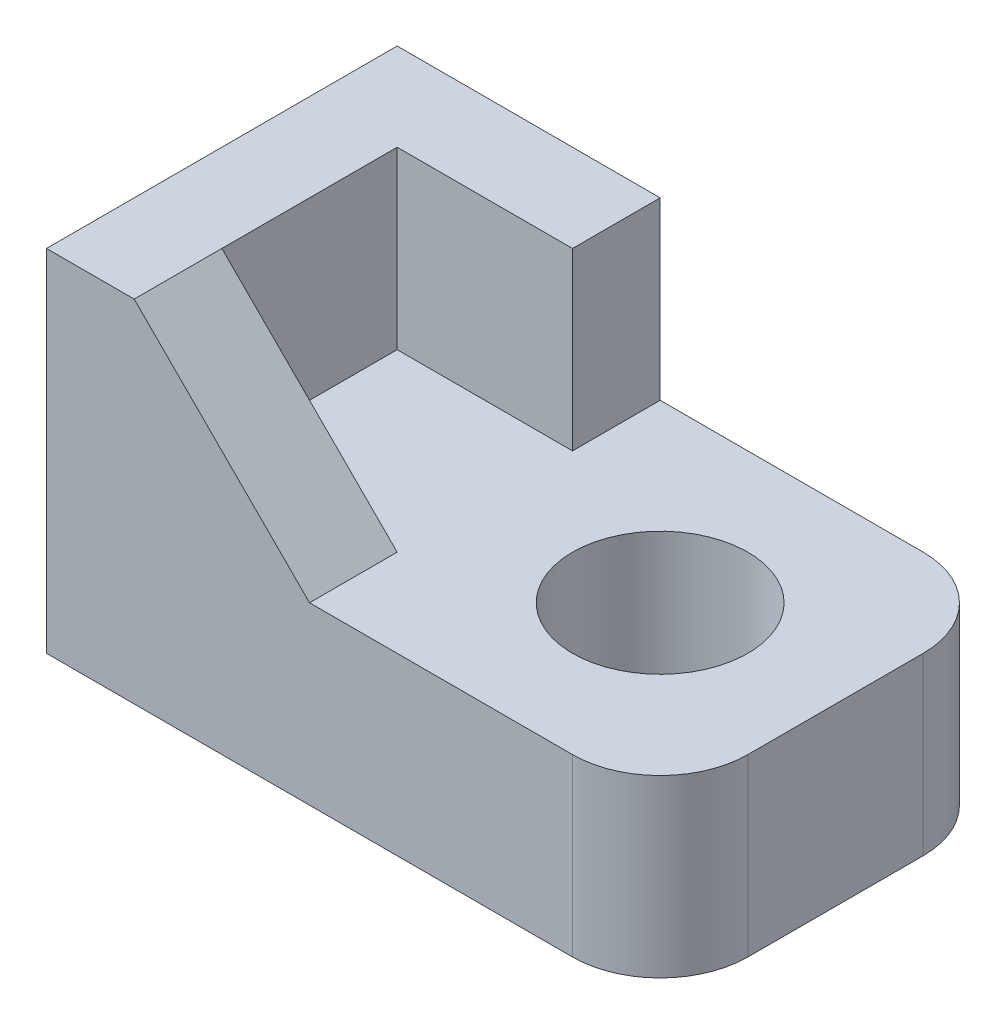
ISO-10303-21;
HEADER;
FILE_DESCRIPTION(('STEP AP214'),'2;1');
FILE_NAME('part.step','',(''),(''),'','','');
FILE_SCHEMA(('AUTOMOTIVE_DESIGN { 1 0 10303 214 1 1 1 1 }'));
ENDSEC;
DATA;
#1=APPLICATION_CONTEXT('core data for automotive mechanical design processes');
#2=APPLICATION_PROTOCOL_DEFINITION('international standard','automotive_design',2000,#1);
#3=PRODUCT_CONTEXT('',#1,'mechanical');
#4=PRODUCT('Part','Part','',(#3));
#5=PRODUCT_RELATED_PRODUCT_CATEGORY('part','',(#4));
#6=PRODUCT_DEFINITION_FORMATION('','',#4);
#7=PRODUCT_DEFINITION_CONTEXT('part definition',#1,'design');
#8=PRODUCT_DEFINITION('design','',#6,#7);
#9=PRODUCT_DEFINITION_SHAPE('','',#8);
#10=(LENGTH_UNIT() NAMED_UNIT(*) SI_UNIT(.MILLI.,.METRE.));
#11=(NAMED_UNIT(*) PLANE_ANGLE_UNIT() SI_UNIT($,.RADIAN.));
#12=(NAMED_UNIT(*) SI_UNIT($,.STERADIAN.) SOLID_ANGLE_UNIT());
#13=UNCERTAINTY_MEASURE_WITH_UNIT(LENGTH_MEASURE(1.E-05),#10,'distance_accuracy_value','');
#14=(GEOMETRIC_REPRESENTATION_CONTEXT(3) GLOBAL_UNCERTAINTY_ASSIGNED_CONTEXT((#13)) GLOBAL_UNIT_ASSIGNED_CONTEXT((#10,
#11,#12)) REPRESENTATION_CONTEXT('',''));
#15=CARTESIAN_POINT('',(0.,0.,0.));
#16=DIRECTION('',(0.,0.,1.));
#17=DIRECTION('',(1.,0.,0.));
#18=AXIS2_PLACEMENT_3D('',#15,#16,#17);
#19=CARTESIAN_POINT('',(30.,40.,20.));
#20=DIRECTION('',(0.,-1.,0.));
#21=DIRECTION('',(1.,0.,0.));
#22=AXIS2_PLACEMENT_3D('',#19,#20,#21);
#23=PLANE('',#22);
#24=DIRECTION('',(0.,0.,-1.));
#25=VECTOR('',#24,1.);
#26=CARTESIAN_POINT('',(10.,40.,20.));
#27=LINE('',#26,#25);
#28=CARTESIAN_POINT('',(10.,40.,20.));
#29=VERTEX_POINT('',#28);
#30=CARTESIAN_POINT('',(10.,40.,10.));
#31=VERTEX_POINT('',#30);
#32=EDGE_CURVE('E119',#29,#31,#27,.T.);
#33=ORIENTED_EDGE('',*,*,#32,.T.);
#34=DIRECTION('',(0.,0.,1.));
#35=VECTOR('',#34,1.);
#36=CARTESIAN_POINT('',(10.,40.,-10.));
#37=LINE('',#36,#35);
#38=CARTESIAN_POINT('',(10.,40.,-10.));
#39=VERTEX_POINT('',#38);
#40=EDGE_CURVE('E223',#39,#31,#37,.T.);
#41=ORIENTED_EDGE('',*,*,#40,.F.);
#42=DIRECTION('',(-1.,0.,0.));
#43=VECTOR('',#42,1.);
#44=CARTESIAN_POINT('',(20.,40.,-10.));
#45=LINE('',#44,#43);
#46=CARTESIAN_POINT('',(30.,40.,-10.));
#47=VERTEX_POINT('',#46);
#48=EDGE_CURVE('E227',#47,#39,#45,.T.);
#49=ORIENTED_EDGE('',*,*,#48,.F.);
#50=DIRECTION('',(0.,0.,-1.));
#51=VECTOR('',#50,1.);
#52=CARTESIAN_POINT('',(30.,40.,20.));
#53=LINE('',#52,#51);
#54=CARTESIAN_POINT('',(30.,40.,-20.));
#55=VERTEX_POINT('',#54);
#56=EDGE_CURVE('E145',#47,#55,#53,.T.);
#57=ORIENTED_EDGE('',*,*,#56,.T.);
#58=DIRECTION('',(-1.,0.,0.));
#59=VECTOR('',#58,1.);
#60=CARTESIAN_POINT('',(30.,40.,-20.));
#61=LINE('',#60,#59);
#62=CARTESIAN_POINT('',(0.,40.,-20.));
#63=VERTEX_POINT('',#62);
#64=EDGE_CURVE('E162',#55,#63,#61,.T.);
#65=ORIENTED_EDGE('',*,*,#64,.T.);
#66=DIRECTION('',(0.,0.,-1.));
#67=VECTOR('',#66,1.);
#68=CARTESIAN_POINT('',(0.,40.,20.));
#69=LINE('',#68,#67);
#70=CARTESIAN_POINT('',(0.,40.,20.));
#71=VERTEX_POINT('',#70);
#72=EDGE_CURVE('E142',#71,#63,#69,.T.);
#73=ORIENTED_EDGE('',*,*,#72,.F.);
#74=DIRECTION('',(-1.,0.,0.));
#75=VECTOR('',#74,1.);
#76=CARTESIAN_POINT('',(30.,40.,20.));
#77=LINE('',#76,#75);
#78=EDGE_CURVE('E135',#29,#71,#77,.T.);
#79=ORIENTED_EDGE('',*,*,#78,.F.);
#80=EDGE_LOOP('',(#33,#41,#49,#57,#65,#73,#79));
#81=FACE_BOUND('',#80,.T.);
#82=ADVANCED_FACE('F30',(#81),#23,.F.);
#83=CARTESIAN_POINT('',(0.,0.,20.));
#84=DIRECTION('',(0.,0.,1.));
#85=DIRECTION('',(1.,0.,0.));
#86=AXIS2_PLACEMENT_3D('',#83,#84,#85);
#87=PLANE('',#86);
#88=DIRECTION('',(1.,0.,0.));
#89=VECTOR('',#88,1.);
#90=CARTESIAN_POINT('',(0.,0.,20.));
#91=LINE('',#90,#89);
#92=CARTESIAN_POINT('',(0.,0.,20.));
#93=VERTEX_POINT('',#92);
#94=CARTESIAN_POINT('',(60.,0.,20.));
#95=VERTEX_POINT('',#94);
#96=EDGE_CURVE('E147',#93,#95,#91,.T.);
#97=ORIENTED_EDGE('',*,*,#96,.T.);
#98=DIRECTION('',(0.,1.,0.));
#99=VECTOR('',#98,1.);
#100=CARTESIAN_POINT('',(60.,20.,20.));
#101=LINE('',#100,#99);
#102=CARTESIAN_POINT('',(60.,20.,20.));
#103=VERTEX_POINT('',#102);
#104=EDGE_CURVE('E11',#95,#103,#101,.T.);
#105=ORIENTED_EDGE('',*,*,#104,.T.);
#106=DIRECTION('',(-1.,0.,0.));
#107=VECTOR('',#106,1.);
#108=CARTESIAN_POINT('',(70.,20.,20.));
#109=LINE('',#108,#107);
#110=CARTESIAN_POINT('',(30.,20.,20.));
#111=VERTEX_POINT('',#110);
#112=EDGE_CURVE('E138',#103,#111,#109,.T.);
#113=ORIENTED_EDGE('',*,*,#112,.T.);
#114=DIRECTION('',(0.707106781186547,-0.707106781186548,0.));
#115=VECTOR('',#114,1.);
#116=CARTESIAN_POINT('',(31.0707106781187,18.9292893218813,20.));
#117=LINE('',#116,#115);
#118=EDGE_CURVE('E122',#29,#111,#117,.T.);
#119=ORIENTED_EDGE('',*,*,#118,.F.);
#120=ORIENTED_EDGE('',*,*,#78,.T.);
#121=DIRECTION('',(0.,-1.,0.));
#122=VECTOR('',#121,1.);
#123=CARTESIAN_POINT('',(0.,40.,20.));
#124=LINE('',#123,#122);
#125=EDGE_CURVE('E163',#71,#93,#124,.T.);
#126=ORIENTED_EDGE('',*,*,#125,.T.);
#127=EDGE_LOOP('',(#97,#105,#113,#119,#120,#126));
#128=FACE_BOUND('',#127,.T.);
#129=ADVANCED_FACE('F133',(#128),#87,.T.);
#130=CARTESIAN_POINT('',(20.,7.85857864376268,10.));
#131=DIRECTION('',(0.,0.,1.));
#132=DIRECTION('',(1.,0.,0.));
#133=AXIS2_PLACEMENT_3D('',#130,#131,#132);
#134=PLANE('',#133);
#135=DIRECTION('',(-0.707106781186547,0.707106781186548,0.));
#136=VECTOR('',#135,1.);
#137=CARTESIAN_POINT('',(31.0707106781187,18.9292893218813,10.));
#138=LINE('',#137,#136);
#139=CARTESIAN_POINT('',(30.,20.,10.));
#140=VERTEX_POINT('',#139);
#141=EDGE_CURVE('E125',#140,#31,#138,.T.);
#142=ORIENTED_EDGE('',*,*,#141,.F.);
#143=DIRECTION('',(-1.,0.,0.));
#144=VECTOR('',#143,1.);
#145=CARTESIAN_POINT('',(20.,20.,10.));
#146=LINE('',#145,#144);
#147=CARTESIAN_POINT('',(10.,20.,10.));
#148=VERTEX_POINT('',#147);
#149=EDGE_CURVE('E229',#140,#148,#146,.T.);
#150=ORIENTED_EDGE('',*,*,#149,.T.);
#151=DIRECTION('',(0.,-1.,0.));
#152=VECTOR('',#151,1.);
#153=CARTESIAN_POINT('',(10.,7.85857864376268,10.));
#154=LINE('',#153,#152);
#155=EDGE_CURVE('E130',#31,#148,#154,.T.);
#156=ORIENTED_EDGE('',*,*,#155,.F.);
#157=EDGE_LOOP('',(#142,#150,#156));
#158=FACE_BOUND('',#157,.T.);
#159=ADVANCED_FACE('F240',(#158),#134,.F.);
#160=CARTESIAN_POINT('',(30.,20.,20.));
#161=DIRECTION('',(-1.,0.,0.));
#162=DIRECTION('',(0.,-1.,0.));
#163=AXIS2_PLACEMENT_3D('',#160,#161,#162);
#164=PLANE('',#163);
#165=DIRECTION('',(0.,-1.,0.));
#166=VECTOR('',#165,1.);
#167=CARTESIAN_POINT('',(30.,7.85857864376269,-10.));
#168=LINE('',#167,#166);
#169=CARTESIAN_POINT('',(30.,20.,-10.));
#170=VERTEX_POINT('',#169);
#171=EDGE_CURVE('E210',#47,#170,#168,.T.);
#172=ORIENTED_EDGE('',*,*,#171,.T.);
#173=DIRECTION('',(0.,0.,-1.));
#174=VECTOR('',#173,1.);
#175=CARTESIAN_POINT('',(30.,20.,20.));
#176=LINE('',#175,#174);
#177=CARTESIAN_POINT('',(30.,20.,-20.));
#178=VERTEX_POINT('',#177);
#179=EDGE_CURVE('E166',#170,#178,#176,.T.);
#180=ORIENTED_EDGE('',*,*,#179,.T.);
#181=DIRECTION('',(0.,1.,0.));
#182=VECTOR('',#181,1.);
#183=CARTESIAN_POINT('',(30.,20.,-20.));
#184=LINE('',#183,#182);
#185=EDGE_CURVE('E159',#178,#55,#184,.T.);
#186=ORIENTED_EDGE('',*,*,#185,.T.);
#187=ORIENTED_EDGE('',*,*,#56,.F.);
#188=EDGE_LOOP('',(#172,#180,#186,#187));
#189=FACE_BOUND('',#188,.T.);
#190=ADVANCED_FACE('F209',(#189),#164,.F.);
#191=CARTESIAN_POINT('',(0.,40.,20.));
#192=DIRECTION('',(1.,0.,0.));
#193=DIRECTION('',(0.,1.,0.));
#194=AXIS2_PLACEMENT_3D('',#191,#192,#193);
#195=PLANE('',#194);
#196=DIRECTION('',(0.,-1.,0.));
#197=VECTOR('',#196,1.);
#198=CARTESIAN_POINT('',(0.,40.,-20.));
#199=LINE('',#198,#197);
#200=CARTESIAN_POINT('',(0.,0.,-20.));
#201=VERTEX_POINT('',#200);
#202=EDGE_CURVE('E151',#63,#201,#199,.T.);
#203=ORIENTED_EDGE('',*,*,#202,.T.);
#204=DIRECTION('',(0.,0.,-1.));
#205=VECTOR('',#204,1.);
#206=CARTESIAN_POINT('',(0.,0.,20.));
#207=LINE('',#206,#205);
#208=EDGE_CURVE('E175',#93,#201,#207,.T.);
#209=ORIENTED_EDGE('',*,*,#208,.F.);
#210=ORIENTED_EDGE('',*,*,#125,.F.);
#211=ORIENTED_EDGE('',*,*,#72,.T.);
#212=EDGE_LOOP('',(#203,#209,#210,#211));
#213=FACE_BOUND('',#212,.T.);
#214=ADVANCED_FACE('F247',(#213),#195,.F.);
#215=CARTESIAN_POINT('',(0.,0.,20.));
#216=DIRECTION('',(0.,1.,0.));
#217=DIRECTION('',(0.,0.,1.));
#218=AXIS2_PLACEMENT_3D('',#215,#216,#217);
#219=PLANE('',#218);
#220=CARTESIAN_POINT('',(50.,0.,0.));
#221=DIRECTION('',(0.,1.,0.));
#222=DIRECTION('',(-1.,0.,0.));
#223=AXIS2_PLACEMENT_3D('',#220,#221,#222);
#224=CIRCLE('',#223,9.99999999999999);
#225=CARTESIAN_POINT('',(40.,0.,0.));
#226=VERTEX_POINT('',#225);
#227=EDGE_CURVE('E139',#226,#226,#224,.T.);
#228=ORIENTED_EDGE('',*,*,#227,.T.);
#229=EDGE_LOOP('',(#228));
#230=FACE_BOUND('',#229,.T.);
#231=DIRECTION('',(1.,0.,0.));
#232=VECTOR('',#231,1.);
#233=CARTESIAN_POINT('',(0.,0.,-20.));
#234=LINE('',#233,#232);
#235=CARTESIAN_POINT('',(60.,0.,-20.));
#236=VERTEX_POINT('',#235);
#237=EDGE_CURVE('E154',#201,#236,#234,.T.);
#238=ORIENTED_EDGE('',*,*,#237,.T.);
#239=CARTESIAN_POINT('',(60.,0.,-10.));
#240=DIRECTION('',(0.,1.,0.));
#241=DIRECTION('',(0.,0.,1.));
#242=AXIS2_PLACEMENT_3D('',#239,#240,#241);
#243=CIRCLE('',#242,10.);
#244=CARTESIAN_POINT('',(70.,0.,-10.));
#245=VERTEX_POINT('',#244);
#246=EDGE_CURVE('E38',#236,#245,#243,.F.);
#247=ORIENTED_EDGE('',*,*,#246,.T.);
#248=DIRECTION('',(0.,0.,-1.));
#249=VECTOR('',#248,1.);
#250=CARTESIAN_POINT('',(70.,0.,20.));
#251=LINE('',#250,#249);
#252=CARTESIAN_POINT('',(70.,0.,10.));
#253=VERTEX_POINT('',#252);
#254=EDGE_CURVE('E172',#253,#245,#251,.T.);
#255=ORIENTED_EDGE('',*,*,#254,.F.);
#256=CARTESIAN_POINT('',(60.,0.,10.));
#257=DIRECTION('',(0.,1.,0.));
#258=DIRECTION('',(0.,0.,1.));
#259=AXIS2_PLACEMENT_3D('',#256,#257,#258);
#260=CIRCLE('',#259,10.);
#261=EDGE_CURVE('E45',#253,#95,#260,.F.);
#262=ORIENTED_EDGE('',*,*,#261,.T.);
#263=ORIENTED_EDGE('',*,*,#96,.F.);
#264=ORIENTED_EDGE('',*,*,#208,.T.);
#265=EDGE_LOOP('',(#238,#247,#255,#262,#263,#264));
#266=FACE_BOUND('',#265,.T.);
#267=ADVANCED_FACE('F190',(#230,#266),#219,.F.);
#268=CARTESIAN_POINT('',(70.,0.,20.));
#269=DIRECTION('',(-1.,0.,0.));
#270=DIRECTION('',(0.,0.,1.));
#271=AXIS2_PLACEMENT_3D('',#268,#269,#270);
#272=PLANE('',#271);
#273=ORIENTED_EDGE('',*,*,#254,.T.);
#274=DIRECTION('',(0.,1.,0.));
#275=VECTOR('',#274,1.);
#276=CARTESIAN_POINT('',(70.,0.,-10.));
#277=LINE('',#276,#275);
#278=CARTESIAN_POINT('',(70.,20.,-10.));
#279=VERTEX_POINT('',#278);
#280=EDGE_CURVE('E181',#245,#279,#277,.T.);
#281=ORIENTED_EDGE('',*,*,#280,.T.);
#282=DIRECTION('',(0.,0.,-1.));
#283=VECTOR('',#282,1.);
#284=CARTESIAN_POINT('',(70.,20.,20.));
#285=LINE('',#284,#283);
#286=CARTESIAN_POINT('',(70.,20.,10.));
#287=VERTEX_POINT('',#286);
#288=EDGE_CURVE('E169',#287,#279,#285,.T.);
#289=ORIENTED_EDGE('',*,*,#288,.F.);
#290=DIRECTION('',(0.,1.,0.));
#291=VECTOR('',#290,1.);
#292=CARTESIAN_POINT('',(70.,0.,10.));
#293=LINE('',#292,#291);
#294=EDGE_CURVE('E179',#287,#253,#293,.F.);
#295=ORIENTED_EDGE('',*,*,#294,.T.);
#296=EDGE_LOOP('',(#273,#281,#289,#295));
#297=FACE_BOUND('',#296,.T.);
#298=ADVANCED_FACE('F194',(#297),#272,.F.);
#299=CARTESIAN_POINT('',(70.,20.,20.));
#300=DIRECTION('',(0.,-1.,0.));
#301=DIRECTION('',(1.,0.,0.));
#302=AXIS2_PLACEMENT_3D('',#299,#300,#301);
#303=PLANE('',#302);
#304=CARTESIAN_POINT('',(50.,20.,0.));
#305=DIRECTION('',(0.,1.,0.));
#306=DIRECTION('',(-1.,0.,0.));
#307=AXIS2_PLACEMENT_3D('',#304,#305,#306);
#308=CIRCLE('',#307,9.99999999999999);
#309=CARTESIAN_POINT('',(40.,20.,0.));
#310=VERTEX_POINT('',#309);
#311=EDGE_CURVE('E379',#310,#310,#308,.T.);
#312=ORIENTED_EDGE('',*,*,#311,.F.);
#313=EDGE_LOOP('',(#312));
#314=FACE_BOUND('',#313,.T.);
#315=ORIENTED_EDGE('',*,*,#288,.T.);
#316=CARTESIAN_POINT('',(60.,20.,-10.));
#317=DIRECTION('',(0.,-1.,0.));
#318=DIRECTION('',(1.,0.,0.));
#319=AXIS2_PLACEMENT_3D('',#316,#317,#318);
#320=CIRCLE('',#319,10.);
#321=CARTESIAN_POINT('',(60.,20.,-20.));
#322=VERTEX_POINT('',#321);
#323=EDGE_CURVE('E186',#279,#322,#320,.F.);
#324=ORIENTED_EDGE('',*,*,#323,.T.);
#325=DIRECTION('',(-1.,0.,0.));
#326=VECTOR('',#325,1.);
#327=CARTESIAN_POINT('',(70.,20.,-20.));
#328=LINE('',#327,#326);
#329=EDGE_CURVE('E157',#322,#178,#328,.T.);
#330=ORIENTED_EDGE('',*,*,#329,.T.);
#331=ORIENTED_EDGE('',*,*,#179,.F.);
#332=DIRECTION('',(-1.,0.,0.));
#333=VECTOR('',#332,1.);
#334=CARTESIAN_POINT('',(20.,20.,-10.));
#335=LINE('',#334,#333);
#336=CARTESIAN_POINT('',(10.,20.,-10.));
#337=VERTEX_POINT('',#336);
#338=EDGE_CURVE('E211',#170,#337,#335,.T.);
#339=ORIENTED_EDGE('',*,*,#338,.T.);
#340=DIRECTION('',(0.,0.,1.));
#341=VECTOR('',#340,1.);
#342=CARTESIAN_POINT('',(10.,20.,-10.));
#343=LINE('',#342,#341);
#344=EDGE_CURVE('E155',#337,#148,#343,.T.);
#345=ORIENTED_EDGE('',*,*,#344,.T.);
#346=ORIENTED_EDGE('',*,*,#149,.F.);
#347=EDGE_CURVE('E167',#111,#140,#176,.T.);
#348=ORIENTED_EDGE('',*,*,#347,.F.);
#349=ORIENTED_EDGE('',*,*,#112,.F.);
#350=CARTESIAN_POINT('',(60.,20.,10.));
#351=DIRECTION('',(0.,-1.,0.));
#352=DIRECTION('',(1.,0.,0.));
#353=AXIS2_PLACEMENT_3D('',#350,#351,#352);
#354=CIRCLE('',#353,10.);
#355=EDGE_CURVE('E184',#103,#287,#354,.F.);
#356=ORIENTED_EDGE('',*,*,#355,.T.);
#357=EDGE_LOOP('',(#315,#324,#330,#331,#339,#345,#346,#348,#349,#356));
#358=FACE_BOUND('',#357,.T.);
#359=ADVANCED_FACE('F199',(#314,#358),#303,.F.);
#360=CARTESIAN_POINT('',(0.,0.,-20.));
#361=DIRECTION('',(0.,0.,1.));
#362=DIRECTION('',(1.,0.,0.));
#363=AXIS2_PLACEMENT_3D('',#360,#361,#362);
#364=PLANE('',#363);
#365=ORIENTED_EDGE('',*,*,#329,.F.);
#366=DIRECTION('',(0.,1.,0.));
#367=VECTOR('',#366,1.);
#368=CARTESIAN_POINT('',(60.,0.,-20.));
#369=LINE('',#368,#367);
#370=EDGE_CURVE('E53',#322,#236,#369,.F.);
#371=ORIENTED_EDGE('',*,*,#370,.T.);
#372=ORIENTED_EDGE('',*,*,#237,.F.);
#373=ORIENTED_EDGE('',*,*,#202,.F.);
#374=ORIENTED_EDGE('',*,*,#64,.F.);
#375=ORIENTED_EDGE('',*,*,#185,.F.);
#376=EDGE_LOOP('',(#365,#371,#372,#373,#374,#375));
#377=FACE_BOUND('',#376,.T.);
#378=ADVANCED_FACE('F203',(#377),#364,.F.);
#379=CARTESIAN_POINT('',(10.,7.85857864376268,-10.));
#380=DIRECTION('',(-1.,0.,0.));
#381=DIRECTION('',(0.,-1.,0.));
#382=AXIS2_PLACEMENT_3D('',#379,#380,#381);
#383=PLANE('',#382);
#384=ORIENTED_EDGE('',*,*,#155,.T.);
#385=ORIENTED_EDGE('',*,*,#344,.F.);
#386=DIRECTION('',(0.,-1.,0.));
#387=VECTOR('',#386,1.);
#388=CARTESIAN_POINT('',(10.,7.85857864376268,-10.));
#389=LINE('',#388,#387);
#390=EDGE_CURVE('E217',#39,#337,#389,.T.);
#391=ORIENTED_EDGE('',*,*,#390,.F.);
#392=ORIENTED_EDGE('',*,*,#40,.T.);
#393=EDGE_LOOP('',(#384,#385,#391,#392));
#394=FACE_BOUND('',#393,.T.);
#395=ADVANCED_FACE('F221',(#394),#383,.F.);
#396=CARTESIAN_POINT('',(20.,7.85857864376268,-10.));
#397=DIRECTION('',(0.,0.,1.));
#398=DIRECTION('',(1.,0.,0.));
#399=AXIS2_PLACEMENT_3D('',#396,#397,#398);
#400=PLANE('',#399);
#401=ORIENTED_EDGE('',*,*,#48,.T.);
#402=ORIENTED_EDGE('',*,*,#390,.T.);
#403=ORIENTED_EDGE('',*,*,#338,.F.);
#404=ORIENTED_EDGE('',*,*,#171,.F.);
#405=EDGE_LOOP('',(#401,#402,#403,#404));
#406=FACE_BOUND('',#405,.T.);
#407=ADVANCED_FACE('F225',(#406),#400,.T.);
#408=CARTESIAN_POINT('',(31.0707106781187,18.9292893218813,20.));
#409=DIRECTION('',(0.707106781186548,0.707106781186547,0.));
#410=DIRECTION('',(-0.707106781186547,0.707106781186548,0.));
#411=AXIS2_PLACEMENT_3D('',#408,#409,#410);
#412=PLANE('',#411);
#413=ORIENTED_EDGE('',*,*,#141,.T.);
#414=ORIENTED_EDGE('',*,*,#32,.F.);
#415=ORIENTED_EDGE('',*,*,#118,.T.);
#416=ORIENTED_EDGE('',*,*,#347,.T.);
#417=EDGE_LOOP('',(#413,#414,#415,#416));
#418=FACE_BOUND('',#417,.T.);
#419=ADVANCED_FACE('F121',(#418),#412,.T.);
#420=CARTESIAN_POINT('',(50.,0.,0.));
#421=DIRECTION('',(0.,1.,0.));
#422=DIRECTION('',(-1.,0.,0.));
#423=AXIS2_PLACEMENT_3D('',#420,#421,#422);
#424=CYLINDRICAL_SURFACE('',#423,9.99999999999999);
#425=ORIENTED_EDGE('',*,*,#227,.F.);
#426=EDGE_LOOP('',(#425));
#427=FACE_BOUND('',#426,.T.);
#428=ORIENTED_EDGE('',*,*,#311,.T.);
#429=EDGE_LOOP('',(#428));
#430=FACE_BOUND('',#429,.T.);
#431=ADVANCED_FACE('F269',(#427,#430),#424,.F.);
#432=CARTESIAN_POINT('',(60.,0.,-10.));
#433=DIRECTION('',(0.,1.,0.));
#434=DIRECTION('',(0.,0.,1.));
#435=AXIS2_PLACEMENT_3D('',#432,#433,#434);
#436=CYLINDRICAL_SURFACE('',#435,10.);
#437=ORIENTED_EDGE('',*,*,#246,.F.);
#438=ORIENTED_EDGE('',*,*,#370,.F.);
#439=ORIENTED_EDGE('',*,*,#323,.F.);
#440=ORIENTED_EDGE('',*,*,#280,.F.);
#441=EDGE_LOOP('',(#437,#438,#439,#440));
#442=FACE_BOUND('',#441,.T.);
#443=ADVANCED_FACE('F197',(#442),#436,.T.);
#444=CARTESIAN_POINT('',(60.,0.,10.));
#445=DIRECTION('',(0.,-1.,0.));
#446=DIRECTION('',(0.,0.,-1.));
#447=AXIS2_PLACEMENT_3D('',#444,#445,#446);
#448=CYLINDRICAL_SURFACE('',#447,10.);
#449=ORIENTED_EDGE('',*,*,#261,.F.);
#450=ORIENTED_EDGE('',*,*,#294,.F.);
#451=ORIENTED_EDGE('',*,*,#355,.F.);
#452=ORIENTED_EDGE('',*,*,#104,.F.);
#453=EDGE_LOOP('',(#449,#450,#451,#452));
#454=FACE_BOUND('',#453,.T.);
#455=ADVANCED_FACE('F32',(#454),#448,.T.);
#456=CLOSED_SHELL('',(#82,#129,#159,#190,#214,#267,#298,#359,#378,#395,#407,#419,#431,#443,#455));
#457=MANIFOLD_SOLID_BREP('B2',#456);
#458=ADVANCED_BREP_SHAPE_REPRESENTATION('',(#18,#457),#14);
#459=SHAPE_DEFINITION_REPRESENTATION(#9,#458);
ENDSEC;
END-ISO-10303-21;
